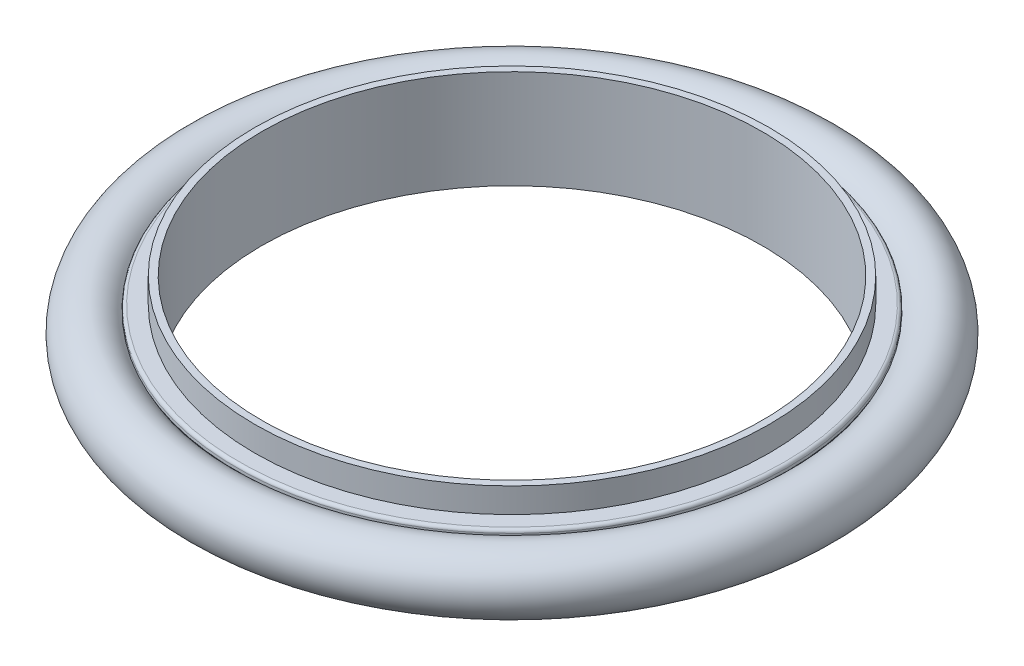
ISO-10303-21;
HEADER;
FILE_DESCRIPTION(('STEP AP214'),'2;1');
FILE_NAME('part.step','',(''),(''),'','','');
FILE_SCHEMA(('AUTOMOTIVE_DESIGN { 1 0 10303 214 1 1 1 1 }'));
ENDSEC;
DATA;
#1=APPLICATION_CONTEXT('core data for automotive mechanical design processes');
#2=APPLICATION_PROTOCOL_DEFINITION('international standard','automotive_design',2000,#1);
#3=PRODUCT_CONTEXT('',#1,'mechanical');
#4=PRODUCT('Part','Part','',(#3));
#5=PRODUCT_RELATED_PRODUCT_CATEGORY('part','',(#4));
#6=PRODUCT_DEFINITION_FORMATION('','',#4);
#7=PRODUCT_DEFINITION_CONTEXT('part definition',#1,'design');
#8=PRODUCT_DEFINITION('design','',#6,#7);
#9=PRODUCT_DEFINITION_SHAPE('','',#8);
#10=(LENGTH_UNIT() NAMED_UNIT(*) SI_UNIT(.MILLI.,.METRE.));
#11=(NAMED_UNIT(*) PLANE_ANGLE_UNIT() SI_UNIT($,.RADIAN.));
#12=(NAMED_UNIT(*) SI_UNIT($,.STERADIAN.) SOLID_ANGLE_UNIT());
#13=UNCERTAINTY_MEASURE_WITH_UNIT(LENGTH_MEASURE(1.E-05),#10,'distance_accuracy_value','');
#14=(GEOMETRIC_REPRESENTATION_CONTEXT(3) GLOBAL_UNCERTAINTY_ASSIGNED_CONTEXT((#13)) GLOBAL_UNIT_ASSIGNED_CONTEXT((#10,
#11,#12)) REPRESENTATION_CONTEXT('',''));
#15=CARTESIAN_POINT('',(0.,0.,0.));
#16=DIRECTION('',(0.,0.,1.));
#17=DIRECTION('',(1.,0.,0.));
#18=AXIS2_PLACEMENT_3D('',#15,#16,#17);
#19=CARTESIAN_POINT('',(0.,-1.11022302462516E-13,0.));
#20=DIRECTION('',(0.,1.,0.));
#21=DIRECTION('',(0.,0.,1.));
#22=AXIS2_PLACEMENT_3D('',#19,#20,#21);
#23=TOROIDAL_SURFACE('',#22,23.88235,2.38125);
#24=ADVANCED_FACE('P0_F13',(),#23,.T.);
#25=CLOSED_SHELL('',(#24));
#26=MANIFOLD_SOLID_BREP('P0_B1',#25);
#27=CARTESIAN_POINT('',(0.,1.1435867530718E-13,0.));
#28=DIRECTION('',(0.,1.,0.));
#29=DIRECTION('',(-1.,0.,0.));
#30=AXIS2_PLACEMENT_3D('',#27,#28,#29);
#31=TOROIDAL_SURFACE('',#30,24.0410999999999,2.54);
#32=CARTESIAN_POINT('',(0.,1.47183082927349,0.));
#33=DIRECTION('',(0.,1.,0.));
#34=DIRECTION('',(-1.,0.,0.));
#35=AXIS2_PLACEMENT_3D('',#32,#33,#34);
#36=CIRCLE('',#35,21.971);
#37=CARTESIAN_POINT('',(-21.971,1.47183082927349,0.));
#38=VERTEX_POINT('',#37);
#39=EDGE_CURVE('P1_E165',#38,#38,#36,.T.);
#40=ORIENTED_EDGE('',*,*,#39,.F.);
#41=EDGE_LOOP('',(#40));
#42=FACE_BOUND('',#41,.T.);
#43=CARTESIAN_POINT('',(-2.22044604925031E-13,-1.4718308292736,0.));
#44=DIRECTION('',(0.,1.,0.));
#45=DIRECTION('',(-1.,0.,0.));
#46=AXIS2_PLACEMENT_3D('',#43,#44,#45);
#47=CIRCLE('',#46,21.971);
#48=CARTESIAN_POINT('',(-21.971,-1.4718308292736,0.));
#49=VERTEX_POINT('',#48);
#50=EDGE_CURVE('P1_E167',#49,#49,#47,.F.);
#51=ORIENTED_EDGE('',*,*,#50,.F.);
#52=EDGE_LOOP('',(#51));
#53=FACE_BOUND('',#52,.T.);
#54=ADVANCED_FACE('P1_F18',(#42,#53),#31,.F.);
#55=CARTESIAN_POINT('',(0.,0.,0.));
#56=DIRECTION('',(0.,1.,0.));
#57=DIRECTION('',(-1.,0.,0.));
#58=AXIS2_PLACEMENT_3D('',#55,#56,#57);
#59=CYLINDRICAL_SURFACE('',#58,21.971);
#60=CARTESIAN_POINT('',(1.11022302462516E-13,1.70179999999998,0.));
#61=DIRECTION('',(0.,1.,0.));
#62=DIRECTION('',(-1.,0.,0.));
#63=AXIS2_PLACEMENT_3D('',#60,#61,#62);
#64=CIRCLE('',#63,21.971);
#65=CARTESIAN_POINT('',(-21.971,1.70179999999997,0.));
#66=VERTEX_POINT('',#65);
#67=EDGE_CURVE('P1_E169',#66,#66,#64,.T.);
#68=CARTESIAN_POINT('',(-21.971,1.47183082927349,0.));
#69=CARTESIAN_POINT('',(-21.971,1.47422634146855,0.));
#70=CARTESIAN_POINT('',(-21.971,1.47662185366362,0.));
#71=CARTESIAN_POINT('',(-21.971,1.48141287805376,0.));
#72=CARTESIAN_POINT('',(-21.971,1.48380839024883,0.));
#73=CARTESIAN_POINT('',(-21.971,1.48859941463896,0.));
#74=CARTESIAN_POINT('',(-21.971,1.49099492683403,0.));
#75=CARTESIAN_POINT('',(-21.971,1.49578595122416,0.));
#76=CARTESIAN_POINT('',(-21.971,1.49818146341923,0.));
#77=CARTESIAN_POINT('',(-21.971,1.50297248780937,0.));
#78=CARTESIAN_POINT('',(-21.971,1.50536800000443,0.));
#79=CARTESIAN_POINT('',(-21.971,1.51015902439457,0.));
#80=CARTESIAN_POINT('',(-21.971,1.51255453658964,0.));
#81=CARTESIAN_POINT('',(-21.971,1.51734556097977,0.));
#82=CARTESIAN_POINT('',(-21.971,1.51974107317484,0.));
#83=CARTESIAN_POINT('',(-21.971,1.52453209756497,0.));
#84=CARTESIAN_POINT('',(-21.971,1.52692760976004,0.));
#85=CARTESIAN_POINT('',(-21.971,1.53171863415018,0.));
#86=CARTESIAN_POINT('',(-21.971,1.53411414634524,0.));
#87=CARTESIAN_POINT('',(-21.971,1.53890517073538,0.));
#88=CARTESIAN_POINT('',(-21.971,1.54130068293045,0.));
#89=CARTESIAN_POINT('',(-21.971,1.54609170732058,0.));
#90=CARTESIAN_POINT('',(-21.971,1.54848721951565,0.));
#91=CARTESIAN_POINT('',(-21.971,1.55327824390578,0.));
#92=CARTESIAN_POINT('',(-21.971,1.55567375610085,0.));
#93=CARTESIAN_POINT('',(-21.971,1.56046478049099,0.));
#94=CARTESIAN_POINT('',(-21.971,1.56286029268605,0.));
#95=CARTESIAN_POINT('',(-21.971,1.56765131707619,0.));
#96=CARTESIAN_POINT('',(-21.971,1.57004682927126,0.));
#97=CARTESIAN_POINT('',(-21.971,1.57483785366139,0.));
#98=CARTESIAN_POINT('',(-21.971,1.57723336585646,0.));
#99=CARTESIAN_POINT('',(-21.971,1.58202439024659,0.));
#100=CARTESIAN_POINT('',(-21.971,1.58441990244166,0.));
#101=CARTESIAN_POINT('',(-21.971,1.5892109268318,0.));
#102=CARTESIAN_POINT('',(-21.971,1.59160643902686,0.));
#103=CARTESIAN_POINT('',(-21.971,1.596397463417,0.));
#104=CARTESIAN_POINT('',(-21.971,1.59879297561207,0.));
#105=CARTESIAN_POINT('',(-21.971,1.6035840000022,0.));
#106=CARTESIAN_POINT('',(-21.971,1.60597951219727,0.));
#107=CARTESIAN_POINT('',(-21.971,1.61077053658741,0.));
#108=CARTESIAN_POINT('',(-21.971,1.61316604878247,0.));
#109=CARTESIAN_POINT('',(-21.971,1.61795707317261,0.));
#110=CARTESIAN_POINT('',(-21.971,1.62035258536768,0.));
#111=CARTESIAN_POINT('',(-21.971,1.62514360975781,0.));
#112=CARTESIAN_POINT('',(-21.971,1.62753912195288,0.));
#113=CARTESIAN_POINT('',(-21.971,1.63233014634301,0.));
#114=CARTESIAN_POINT('',(-21.971,1.63472565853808,0.));
#115=CARTESIAN_POINT('',(-21.971,1.63951668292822,0.));
#116=CARTESIAN_POINT('',(-21.971,1.64191219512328,0.));
#117=CARTESIAN_POINT('',(-21.971,1.64670321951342,0.));
#118=CARTESIAN_POINT('',(-21.971,1.64909873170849,0.));
#119=CARTESIAN_POINT('',(-21.971,1.65388975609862,0.));
#120=CARTESIAN_POINT('',(-21.971,1.65628526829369,0.));
#121=CARTESIAN_POINT('',(-21.971,1.66107629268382,0.));
#122=CARTESIAN_POINT('',(-21.971,1.66347180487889,0.));
#123=CARTESIAN_POINT('',(-21.971,1.66826282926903,0.));
#124=CARTESIAN_POINT('',(-21.971,1.67065834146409,0.));
#125=CARTESIAN_POINT('',(-21.971,1.67544936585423,0.));
#126=CARTESIAN_POINT('',(-21.971,1.6778448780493,0.));
#127=CARTESIAN_POINT('',(-21.971,1.68263590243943,0.));
#128=CARTESIAN_POINT('',(-21.971,1.6850314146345,0.));
#129=CARTESIAN_POINT('',(-21.971,1.68982243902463,0.));
#130=CARTESIAN_POINT('',(-21.971,1.6922179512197,0.));
#131=CARTESIAN_POINT('',(-21.971,1.69700897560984,0.));
#132=CARTESIAN_POINT('',(-21.971,1.6994044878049,0.));
#133=CARTESIAN_POINT('',(-21.971,1.70179999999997,0.));
#134=B_SPLINE_CURVE_WITH_KNOTS('',3,(#68,#69,#70,#71,#72,#73,#74,#75,#76,#77,#78,#79,#80,#81,
#82,#83,#84,#85,#86,#87,#88,#89,#90,#91,#92,#93,#94,#95,#96,#97,#98,#99,#100,#101,#102,#103,
#104,#105,#106,#107,#108,#109,#110,#111,#112,#113,#114,#115,#116,#117,#118,#119,#120,#121,#122,
#123,#124,#125,#126,#127,#128,#129,#130,#131,#132,#133),.UNSPECIFIED.,.F.,.F.,(4,2,2,2,2,2,2,2,
2,2,2,2,2,2,2,2,2,2,2,2,2,2,2,2,2,2,2,2,2,2,2,2,4),(0.,0.00718653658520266,0.0143730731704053,
0.021559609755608,0.0287461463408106,0.0359326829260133,0.0431192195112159,0.0503057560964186,
0.0574922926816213,0.0646788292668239,0.0718653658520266,0.0790519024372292,0.0862384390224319,
0.0934249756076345,0.100611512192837,0.10779804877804,0.114984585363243,0.122171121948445,
0.129357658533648,0.13654419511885,0.143730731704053,0.150917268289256,0.158103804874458,
0.165290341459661,0.172476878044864,0.179663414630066,0.186849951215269,0.194036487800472,
0.201223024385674,0.208409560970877,0.21559609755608,0.222782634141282,0.229969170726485),.UNSPECIFIED.);
#135=EDGE_CURVE('P1_BSEAM84',#38,#66,#134,.T.);
#136=ORIENTED_EDGE('',*,*,#39,.T.);
#137=ORIENTED_EDGE('',*,*,#67,.F.);
#138=ORIENTED_EDGE('',*,*,#135,.T.);
#139=ORIENTED_EDGE('',*,*,#135,.F.);
#140=EDGE_LOOP('',(#136,#138,#137,#139));
#141=FACE_BOUND('',#140,.T.);
#142=ADVANCED_FACE('P1_F84',(#141),#59,.T.);
#143=CARTESIAN_POINT('',(0.,0.,0.));
#144=DIRECTION('',(0.,1.,0.));
#145=DIRECTION('',(-1.,0.,0.));
#146=AXIS2_PLACEMENT_3D('',#143,#144,#145);
#147=CYLINDRICAL_SURFACE('',#146,21.971);
#148=CARTESIAN_POINT('',(0.,-1.70180000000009,0.));
#149=DIRECTION('',(0.,1.,0.));
#150=DIRECTION('',(-1.,0.,0.));
#151=AXIS2_PLACEMENT_3D('',#148,#149,#150);
#152=CIRCLE('',#151,21.971);
#153=CARTESIAN_POINT('',(-21.971,-1.70180000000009,0.));
#154=VERTEX_POINT('',#153);
#155=EDGE_CURVE('P1_E54',#154,#154,#152,.F.);
#156=CARTESIAN_POINT('',(-21.971,-1.70180000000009,0.));
#157=CARTESIAN_POINT('',(-21.971,-1.69940448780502,0.));
#158=CARTESIAN_POINT('',(-21.971,-1.69700897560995,0.));
#159=CARTESIAN_POINT('',(-21.971,-1.69221795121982,0.));
#160=CARTESIAN_POINT('',(-21.971,-1.68982243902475,0.));
#161=CARTESIAN_POINT('',(-21.971,-1.68503141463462,0.));
#162=CARTESIAN_POINT('',(-21.971,-1.68263590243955,0.));
#163=CARTESIAN_POINT('',(-21.971,-1.67784487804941,0.));
#164=CARTESIAN_POINT('',(-21.971,-1.67544936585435,0.));
#165=CARTESIAN_POINT('',(-21.971,-1.67065834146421,0.));
#166=CARTESIAN_POINT('',(-21.971,-1.66826282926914,0.));
#167=CARTESIAN_POINT('',(-21.971,-1.66347180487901,0.));
#168=CARTESIAN_POINT('',(-21.971,-1.66107629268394,0.));
#169=CARTESIAN_POINT('',(-21.971,-1.65628526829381,0.));
#170=CARTESIAN_POINT('',(-21.971,-1.65388975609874,0.));
#171=CARTESIAN_POINT('',(-21.971,-1.6490987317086,0.));
#172=CARTESIAN_POINT('',(-21.971,-1.64670321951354,0.));
#173=CARTESIAN_POINT('',(-21.971,-1.6419121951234,0.));
#174=CARTESIAN_POINT('',(-21.971,-1.63951668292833,0.));
#175=CARTESIAN_POINT('',(-21.971,-1.6347256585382,0.));
#176=CARTESIAN_POINT('',(-21.971,-1.63233014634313,0.));
#177=CARTESIAN_POINT('',(-21.971,-1.627539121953,0.));
#178=CARTESIAN_POINT('',(-21.971,-1.62514360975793,0.));
#179=CARTESIAN_POINT('',(-21.971,-1.62035258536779,0.));
#180=CARTESIAN_POINT('',(-21.971,-1.61795707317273,0.));
#181=CARTESIAN_POINT('',(-21.971,-1.61316604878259,0.));
#182=CARTESIAN_POINT('',(-21.971,-1.61077053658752,0.));
#183=CARTESIAN_POINT('',(-21.971,-1.60597951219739,0.));
#184=CARTESIAN_POINT('',(-21.971,-1.60358400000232,0.));
#185=CARTESIAN_POINT('',(-21.971,-1.59879297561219,0.));
#186=CARTESIAN_POINT('',(-21.971,-1.59639746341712,0.));
#187=CARTESIAN_POINT('',(-21.971,-1.59160643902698,0.));
#188=CARTESIAN_POINT('',(-21.971,-1.58921092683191,0.));
#189=CARTESIAN_POINT('',(-21.971,-1.58441990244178,0.));
#190=CARTESIAN_POINT('',(-21.971,-1.58202439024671,0.));
#191=CARTESIAN_POINT('',(-21.971,-1.57723336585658,0.));
#192=CARTESIAN_POINT('',(-21.971,-1.57483785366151,0.));
#193=CARTESIAN_POINT('',(-21.971,-1.57004682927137,0.));
#194=CARTESIAN_POINT('',(-21.971,-1.56765131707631,0.));
#195=CARTESIAN_POINT('',(-21.971,-1.56286029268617,0.));
#196=CARTESIAN_POINT('',(-21.971,-1.5604647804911,0.));
#197=CARTESIAN_POINT('',(-21.971,-1.55567375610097,0.));
#198=CARTESIAN_POINT('',(-21.971,-1.5532782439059,0.));
#199=CARTESIAN_POINT('',(-21.971,-1.54848721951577,0.));
#200=CARTESIAN_POINT('',(-21.971,-1.5460917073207,0.));
#201=CARTESIAN_POINT('',(-21.971,-1.54130068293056,0.));
#202=CARTESIAN_POINT('',(-21.971,-1.5389051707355,0.));
#203=CARTESIAN_POINT('',(-21.971,-1.53411414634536,0.));
#204=CARTESIAN_POINT('',(-21.971,-1.53171863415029,0.));
#205=CARTESIAN_POINT('',(-21.971,-1.52692760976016,0.));
#206=CARTESIAN_POINT('',(-21.971,-1.52453209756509,0.));
#207=CARTESIAN_POINT('',(-21.971,-1.51974107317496,0.));
#208=CARTESIAN_POINT('',(-21.971,-1.51734556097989,0.));
#209=CARTESIAN_POINT('',(-21.971,-1.51255453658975,0.));
#210=CARTESIAN_POINT('',(-21.971,-1.51015902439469,0.));
#211=CARTESIAN_POINT('',(-21.971,-1.50536800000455,0.));
#212=CARTESIAN_POINT('',(-21.971,-1.50297248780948,0.));
#213=CARTESIAN_POINT('',(-21.971,-1.49818146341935,0.));
#214=CARTESIAN_POINT('',(-21.971,-1.49578595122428,0.));
#215=CARTESIAN_POINT('',(-21.971,-1.49099492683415,0.));
#216=CARTESIAN_POINT('',(-21.971,-1.48859941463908,0.));
#217=CARTESIAN_POINT('',(-21.971,-1.48380839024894,0.));
#218=CARTESIAN_POINT('',(-21.971,-1.48141287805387,0.));
#219=CARTESIAN_POINT('',(-21.971,-1.47662185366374,0.));
#220=CARTESIAN_POINT('',(-21.971,-1.47422634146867,0.));
#221=CARTESIAN_POINT('',(-21.971,-1.4718308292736,0.));
#222=B_SPLINE_CURVE_WITH_KNOTS('',3,(#156,#157,#158,#159,#160,#161,#162,#163,#164,#165,#166,
#167,#168,#169,#170,#171,#172,#173,#174,#175,#176,#177,#178,#179,#180,#181,#182,#183,#184,#185,
#186,#187,#188,#189,#190,#191,#192,#193,#194,#195,#196,#197,#198,#199,#200,#201,#202,#203,#204,
#205,#206,#207,#208,#209,#210,#211,#212,#213,#214,#215,#216,#217,#218,#219,#220,#221),
.UNSPECIFIED.,.F.,.F.,(4,2,2,2,2,2,2,2,2,2,2,2,2,2,2,2,2,2,2,2,2,2,2,2,2,2,2,2,2,2,2,2,4),(0.,
0.00718653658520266,0.0143730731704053,0.021559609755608,0.0287461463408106,0.0359326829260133,
0.0431192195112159,0.0503057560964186,0.0574922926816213,0.0646788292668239,0.0718653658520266,
0.0790519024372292,0.0862384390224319,0.0934249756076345,0.100611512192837,0.10779804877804,
0.114984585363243,0.122171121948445,0.129357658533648,0.13654419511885,0.143730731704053,
0.150917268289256,0.158103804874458,0.165290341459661,0.172476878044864,0.179663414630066,
0.186849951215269,0.194036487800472,0.201223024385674,0.208409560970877,0.21559609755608,
0.222782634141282,0.229969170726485),.UNSPECIFIED.);
#223=EDGE_CURVE('P1_BSEAM77',#154,#49,#222,.T.);
#224=ORIENTED_EDGE('',*,*,#155,.F.);
#225=ORIENTED_EDGE('',*,*,#50,.T.);
#226=ORIENTED_EDGE('',*,*,#223,.T.);
#227=ORIENTED_EDGE('',*,*,#223,.F.);
#228=EDGE_LOOP('',(#224,#226,#225,#227));
#229=FACE_BOUND('',#228,.T.);
#230=ADVANCED_FACE('P1_F77',(#229),#147,.T.);
#231=CARTESIAN_POINT('',(1.11022302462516E-13,1.70179999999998,0.));
#232=DIRECTION('',(0.,1.,0.));
#233=DIRECTION('',(-1.,0.,0.));
#234=AXIS2_PLACEMENT_3D('',#231,#232,#233);
#235=TOROIDAL_SURFACE('',#234,21.717,0.253999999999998);
#236=ORIENTED_EDGE('',*,*,#67,.T.);
#237=EDGE_LOOP('',(#236));
#238=FACE_BOUND('',#237,.T.);
#239=CARTESIAN_POINT('',(1.10987052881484E-13,1.95579999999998,0.));
#240=DIRECTION('',(0.,-1.,0.));
#241=DIRECTION('',(-1.,0.,0.));
#242=AXIS2_PLACEMENT_3D('',#239,#240,#241);
#243=CIRCLE('',#242,21.717);
#244=CARTESIAN_POINT('',(21.7170000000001,1.95579999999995,0.));
#245=VERTEX_POINT('',#244);
#246=CARTESIAN_POINT('',(-21.7169999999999,1.95579999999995,0.));
#247=VERTEX_POINT('',#246);
#248=EDGE_CURVE('P1_E47',#245,#247,#243,.F.);
#249=ORIENTED_EDGE('',*,*,#248,.F.);
#250=CARTESIAN_POINT('',(1.10987052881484E-13,1.95579999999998,0.));
#251=DIRECTION('',(0.,-1.,0.));
#252=DIRECTION('',(1.,0.,0.));
#253=AXIS2_PLACEMENT_3D('',#250,#251,#252);
#254=CIRCLE('',#253,21.717);
#255=EDGE_CURVE('P1_E50',#247,#245,#254,.F.);
#256=ORIENTED_EDGE('',*,*,#255,.F.);
#257=EDGE_LOOP('',(#249,#256));
#258=FACE_BOUND('',#257,.T.);
#259=ADVANCED_FACE('P1_F58',(#238,#258),#235,.T.);
#260=CARTESIAN_POINT('',(0.,-1.70180000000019,0.));
#261=DIRECTION('',(0.,1.,0.));
#262=DIRECTION('',(-1.,0.,0.));
#263=AXIS2_PLACEMENT_3D('',#260,#261,#262);
#264=TOROIDAL_SURFACE('',#263,21.7169999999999,0.253999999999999);
#265=CARTESIAN_POINT('',(0.,-1.95580000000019,0.));
#266=DIRECTION('',(0.,1.,0.));
#267=DIRECTION('',(-1.,0.,0.));
#268=AXIS2_PLACEMENT_3D('',#265,#266,#267);
#269=CIRCLE('',#268,21.7169999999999);
#270=CARTESIAN_POINT('',(21.7169999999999,-1.95580000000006,0.));
#271=VERTEX_POINT('',#270);
#272=CARTESIAN_POINT('',(-21.717,-1.95580000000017,0.));
#273=VERTEX_POINT('',#272);
#274=EDGE_CURVE('P1_E38',#271,#273,#269,.F.);
#275=ORIENTED_EDGE('',*,*,#274,.F.);
#276=CARTESIAN_POINT('',(0.,-1.95580000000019,0.));
#277=DIRECTION('',(0.,1.,0.));
#278=DIRECTION('',(1.,0.,0.));
#279=AXIS2_PLACEMENT_3D('',#276,#277,#278);
#280=CIRCLE('',#279,21.7169999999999);
#281=EDGE_CURVE('P1_E136',#273,#271,#280,.F.);
#282=ORIENTED_EDGE('',*,*,#281,.F.);
#283=EDGE_LOOP('',(#275,#282));
#284=FACE_BOUND('',#283,.T.);
#285=ORIENTED_EDGE('',*,*,#155,.T.);
#286=EDGE_LOOP('',(#285));
#287=FACE_BOUND('',#286,.T.);
#288=ADVANCED_FACE('P1_F76',(#284,#287),#264,.T.);
#289=CARTESIAN_POINT('',(-20.4977999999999,1.95579999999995,0.));
#290=DIRECTION('',(0.,1.,0.));
#291=DIRECTION('',(-1.,0.,0.));
#292=AXIS2_PLACEMENT_3D('',#289,#290,#291);
#293=PLANE('',#292);
#294=CARTESIAN_POINT('',(1.11022302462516E-13,1.95579999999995,0.));
#295=DIRECTION('',(0.,1.,0.));
#296=DIRECTION('',(-1.,0.,0.));
#297=AXIS2_PLACEMENT_3D('',#294,#295,#296);
#298=CIRCLE('',#297,20.4978);
#299=CARTESIAN_POINT('',(-20.4978,1.95579999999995,0.));
#300=VERTEX_POINT('',#299);
#301=EDGE_CURVE('P1_E140',#300,#300,#298,.T.);
#302=ORIENTED_EDGE('',*,*,#301,.F.);
#303=EDGE_LOOP('',(#302));
#304=FACE_BOUND('',#303,.T.);
#305=ORIENTED_EDGE('',*,*,#255,.T.);
#306=ORIENTED_EDGE('',*,*,#248,.T.);
#307=EDGE_LOOP('',(#305,#306));
#308=FACE_BOUND('',#307,.T.);
#309=ADVANCED_FACE('P1_F52',(#304,#308),#293,.T.);
#310=CARTESIAN_POINT('',(-20.4978,-1.95580000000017,0.));
#311=DIRECTION('',(0.,-1.,0.));
#312=DIRECTION('',(1.,0.,0.));
#313=AXIS2_PLACEMENT_3D('',#310,#311,#312);
#314=PLANE('',#313);
#315=ORIENTED_EDGE('',*,*,#274,.T.);
#316=ORIENTED_EDGE('',*,*,#281,.T.);
#317=EDGE_LOOP('',(#315,#316));
#318=FACE_BOUND('',#317,.T.);
#319=CARTESIAN_POINT('',(1.11022302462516E-13,-1.95580000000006,0.));
#320=DIRECTION('',(0.,1.,0.));
#321=DIRECTION('',(-1.,0.,0.));
#322=AXIS2_PLACEMENT_3D('',#319,#320,#321);
#323=CIRCLE('',#322,20.4978);
#324=CARTESIAN_POINT('',(-20.4978,-1.95580000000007,0.));
#325=VERTEX_POINT('',#324);
#326=EDGE_CURVE('P1_E154',#325,#325,#323,.F.);
#327=ORIENTED_EDGE('',*,*,#326,.F.);
#328=EDGE_LOOP('',(#327));
#329=FACE_BOUND('',#328,.T.);
#330=ADVANCED_FACE('P1_F119',(#318,#329),#314,.T.);
#331=CARTESIAN_POINT('',(0.,0.,0.));
#332=DIRECTION('',(0.,1.,0.));
#333=DIRECTION('',(-1.,0.,0.));
#334=AXIS2_PLACEMENT_3D('',#331,#332,#333);
#335=CYLINDRICAL_SURFACE('',#334,20.4978);
#336=CARTESIAN_POINT('',(0.,3.93699999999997,0.));
#337=DIRECTION('',(0.,1.,0.));
#338=DIRECTION('',(-1.,0.,0.));
#339=AXIS2_PLACEMENT_3D('',#336,#337,#338);
#340=CIRCLE('',#339,20.4978);
#341=CARTESIAN_POINT('',(-20.4978,3.93699999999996,0.));
#342=VERTEX_POINT('',#341);
#343=EDGE_CURVE('P1_E157',#342,#342,#340,.T.);
#344=CARTESIAN_POINT('',(-20.4978,1.95579999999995,0.));
#345=CARTESIAN_POINT('',(-20.4978,1.97643749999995,0.));
#346=CARTESIAN_POINT('',(-20.4978,1.99707499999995,0.));
#347=CARTESIAN_POINT('',(-20.4978,2.03834999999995,0.));
#348=CARTESIAN_POINT('',(-20.4978,2.05898749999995,0.));
#349=CARTESIAN_POINT('',(-20.4978,2.10026249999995,0.));
#350=CARTESIAN_POINT('',(-20.4978,2.12089999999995,0.));
#351=CARTESIAN_POINT('',(-20.4978,2.16217499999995,0.));
#352=CARTESIAN_POINT('',(-20.4978,2.18281249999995,0.));
#353=CARTESIAN_POINT('',(-20.4978,2.22408749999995,0.));
#354=CARTESIAN_POINT('',(-20.4978,2.24472499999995,0.));
#355=CARTESIAN_POINT('',(-20.4978,2.28599999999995,0.));
#356=CARTESIAN_POINT('',(-20.4978,2.30663749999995,0.));
#357=CARTESIAN_POINT('',(-20.4978,2.34791249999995,0.));
#358=CARTESIAN_POINT('',(-20.4978,2.36854999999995,0.));
#359=CARTESIAN_POINT('',(-20.4978,2.40982499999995,0.));
#360=CARTESIAN_POINT('',(-20.4978,2.43046249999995,0.));
#361=CARTESIAN_POINT('',(-20.4978,2.47173749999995,0.));
#362=CARTESIAN_POINT('',(-20.4978,2.49237499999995,0.));
#363=CARTESIAN_POINT('',(-20.4978,2.53364999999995,0.));
#364=CARTESIAN_POINT('',(-20.4978,2.55428749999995,0.));
#365=CARTESIAN_POINT('',(-20.4978,2.59556249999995,0.));
#366=CARTESIAN_POINT('',(-20.4978,2.61619999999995,0.));
#367=CARTESIAN_POINT('',(-20.4978,2.65747499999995,0.));
#368=CARTESIAN_POINT('',(-20.4978,2.67811249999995,0.));
#369=CARTESIAN_POINT('',(-20.4978,2.71938749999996,0.));
#370=CARTESIAN_POINT('',(-20.4978,2.74002499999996,0.));
#371=CARTESIAN_POINT('',(-20.4978,2.78129999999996,0.));
#372=CARTESIAN_POINT('',(-20.4978,2.80193749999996,0.));
#373=CARTESIAN_POINT('',(-20.4978,2.84321249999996,0.));
#374=CARTESIAN_POINT('',(-20.4978,2.86384999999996,0.));
#375=CARTESIAN_POINT('',(-20.4978,2.90512499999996,0.));
#376=CARTESIAN_POINT('',(-20.4978,2.92576249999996,0.));
#377=CARTESIAN_POINT('',(-20.4978,2.96703749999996,0.));
#378=CARTESIAN_POINT('',(-20.4978,2.98767499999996,0.));
#379=CARTESIAN_POINT('',(-20.4978,3.02894999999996,0.));
#380=CARTESIAN_POINT('',(-20.4978,3.04958749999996,0.));
#381=CARTESIAN_POINT('',(-20.4978,3.09086249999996,0.));
#382=CARTESIAN_POINT('',(-20.4978,3.11149999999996,0.));
#383=CARTESIAN_POINT('',(-20.4978,3.15277499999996,0.));
#384=CARTESIAN_POINT('',(-20.4978,3.17341249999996,0.));
#385=CARTESIAN_POINT('',(-20.4978,3.21468749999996,0.));
#386=CARTESIAN_POINT('',(-20.4978,3.23532499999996,0.));
#387=CARTESIAN_POINT('',(-20.4978,3.27659999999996,0.));
#388=CARTESIAN_POINT('',(-20.4978,3.29723749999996,0.));
#389=CARTESIAN_POINT('',(-20.4978,3.33851249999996,0.));
#390=CARTESIAN_POINT('',(-20.4978,3.35914999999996,0.));
#391=CARTESIAN_POINT('',(-20.4978,3.40042499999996,0.));
#392=CARTESIAN_POINT('',(-20.4978,3.42106249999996,0.));
#393=CARTESIAN_POINT('',(-20.4978,3.46233749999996,0.));
#394=CARTESIAN_POINT('',(-20.4978,3.48297499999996,0.));
#395=CARTESIAN_POINT('',(-20.4978,3.52424999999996,0.));
#396=CARTESIAN_POINT('',(-20.4978,3.54488749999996,0.));
#397=CARTESIAN_POINT('',(-20.4978,3.58616249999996,0.));
#398=CARTESIAN_POINT('',(-20.4978,3.60679999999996,0.));
#399=CARTESIAN_POINT('',(-20.4978,3.64807499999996,0.));
#400=CARTESIAN_POINT('',(-20.4978,3.66871249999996,0.));
#401=CARTESIAN_POINT('',(-20.4978,3.70998749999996,0.));
#402=CARTESIAN_POINT('',(-20.4978,3.73062499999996,0.));
#403=CARTESIAN_POINT('',(-20.4978,3.77189999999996,0.));
#404=CARTESIAN_POINT('',(-20.4978,3.79253749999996,0.));
#405=CARTESIAN_POINT('',(-20.4978,3.83381249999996,0.));
#406=CARTESIAN_POINT('',(-20.4978,3.85444999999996,0.));
#407=CARTESIAN_POINT('',(-20.4978,3.89572499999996,0.));
#408=CARTESIAN_POINT('',(-20.4978,3.91636249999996,0.));
#409=CARTESIAN_POINT('',(-20.4978,3.93699999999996,0.));
#410=B_SPLINE_CURVE_WITH_KNOTS('',3,(#344,#345,#346,#347,#348,#349,#350,#351,#352,#353,#354,
#355,#356,#357,#358,#359,#360,#361,#362,#363,#364,#365,#366,#367,#368,#369,#370,#371,#372,#373,
#374,#375,#376,#377,#378,#379,#380,#381,#382,#383,#384,#385,#386,#387,#388,#389,#390,#391,#392,
#393,#394,#395,#396,#397,#398,#399,#400,#401,#402,#403,#404,#405,#406,#407,#408,#409),
.UNSPECIFIED.,.F.,.F.,(4,2,2,2,2,2,2,2,2,2,2,2,2,2,2,2,2,2,2,2,2,2,2,2,2,2,2,2,2,2,2,2,4),(0.,
0.0619125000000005,0.123825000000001,0.185737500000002,0.247650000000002,0.309562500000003,
0.371475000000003,0.433387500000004,0.495300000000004,0.557212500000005,0.619125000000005,
0.681037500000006,0.742950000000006,0.804862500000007,0.866775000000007,0.928687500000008,
0.990600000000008,1.05251250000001,1.11442500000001,1.17633750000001,1.23825000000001,
1.30016250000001,1.36207500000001,1.42398750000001,1.48590000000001,1.54781250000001,
1.60972500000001,1.67163750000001,1.73355000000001,1.79546250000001,1.85737500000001,
1.91928750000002,1.98120000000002),.UNSPECIFIED.);
#411=EDGE_CURVE('P1_BSEAM115',#300,#342,#410,.T.);
#412=ORIENTED_EDGE('',*,*,#301,.T.);
#413=ORIENTED_EDGE('',*,*,#343,.F.);
#414=ORIENTED_EDGE('',*,*,#411,.T.);
#415=ORIENTED_EDGE('',*,*,#411,.F.);
#416=EDGE_LOOP('',(#412,#414,#413,#415));
#417=FACE_BOUND('',#416,.T.);
#418=ADVANCED_FACE('P1_F115',(#417),#335,.T.);
#419=CARTESIAN_POINT('',(0.,0.,0.));
#420=DIRECTION('',(0.,1.,0.));
#421=DIRECTION('',(-1.,0.,0.));
#422=AXIS2_PLACEMENT_3D('',#419,#420,#421);
#423=CYLINDRICAL_SURFACE('',#422,20.4978);
#424=CARTESIAN_POINT('',(0.,-3.93700000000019,0.));
#425=DIRECTION('',(0.,1.,0.));
#426=DIRECTION('',(-1.,0.,0.));
#427=AXIS2_PLACEMENT_3D('',#424,#425,#426);
#428=CIRCLE('',#427,20.4978);
#429=CARTESIAN_POINT('',(-20.4978,-3.93700000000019,0.));
#430=VERTEX_POINT('',#429);
#431=EDGE_CURVE('P1_E160',#430,#430,#428,.F.);
#432=CARTESIAN_POINT('',(-20.4978,-3.93700000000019,0.));
#433=CARTESIAN_POINT('',(-20.4978,-3.91636250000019,0.));
#434=CARTESIAN_POINT('',(-20.4978,-3.89572500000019,0.));
#435=CARTESIAN_POINT('',(-20.4978,-3.85445000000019,0.));
#436=CARTESIAN_POINT('',(-20.4978,-3.83381250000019,0.));
#437=CARTESIAN_POINT('',(-20.4978,-3.79253750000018,0.));
#438=CARTESIAN_POINT('',(-20.4978,-3.77190000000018,0.));
#439=CARTESIAN_POINT('',(-20.4978,-3.73062500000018,0.));
#440=CARTESIAN_POINT('',(-20.4978,-3.70998750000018,0.));
#441=CARTESIAN_POINT('',(-20.4978,-3.66871250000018,0.));
#442=CARTESIAN_POINT('',(-20.4978,-3.64807500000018,0.));
#443=CARTESIAN_POINT('',(-20.4978,-3.60680000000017,0.));
#444=CARTESIAN_POINT('',(-20.4978,-3.58616250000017,0.));
#445=CARTESIAN_POINT('',(-20.4978,-3.54488750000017,0.));
#446=CARTESIAN_POINT('',(-20.4978,-3.52425000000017,0.));
#447=CARTESIAN_POINT('',(-20.4978,-3.48297500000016,0.));
#448=CARTESIAN_POINT('',(-20.4978,-3.46233750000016,0.));
#449=CARTESIAN_POINT('',(-20.4978,-3.42106250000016,0.));
#450=CARTESIAN_POINT('',(-20.4978,-3.40042500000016,0.));
#451=CARTESIAN_POINT('',(-20.4978,-3.35915000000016,0.));
#452=CARTESIAN_POINT('',(-20.4978,-3.33851250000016,0.));
#453=CARTESIAN_POINT('',(-20.4978,-3.29723750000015,0.));
#454=CARTESIAN_POINT('',(-20.4978,-3.27660000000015,0.));
#455=CARTESIAN_POINT('',(-20.4978,-3.23532500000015,0.));
#456=CARTESIAN_POINT('',(-20.4978,-3.21468750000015,0.));
#457=CARTESIAN_POINT('',(-20.4978,-3.17341250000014,0.));
#458=CARTESIAN_POINT('',(-20.4978,-3.15277500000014,0.));
#459=CARTESIAN_POINT('',(-20.4978,-3.11150000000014,0.));
#460=CARTESIAN_POINT('',(-20.4978,-3.09086250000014,0.));
#461=CARTESIAN_POINT('',(-20.4978,-3.04958750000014,0.));
#462=CARTESIAN_POINT('',(-20.4978,-3.02895000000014,0.));
#463=CARTESIAN_POINT('',(-20.4978,-2.98767500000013,0.));
#464=CARTESIAN_POINT('',(-20.4978,-2.96703750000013,0.));
#465=CARTESIAN_POINT('',(-20.4978,-2.92576250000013,0.));
#466=CARTESIAN_POINT('',(-20.4978,-2.90512500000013,0.));
#467=CARTESIAN_POINT('',(-20.4978,-2.86385000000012,0.));
#468=CARTESIAN_POINT('',(-20.4978,-2.84321250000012,0.));
#469=CARTESIAN_POINT('',(-20.4978,-2.80193750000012,0.));
#470=CARTESIAN_POINT('',(-20.4978,-2.78130000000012,0.));
#471=CARTESIAN_POINT('',(-20.4978,-2.74002500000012,0.));
#472=CARTESIAN_POINT('',(-20.4978,-2.71938750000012,0.));
#473=CARTESIAN_POINT('',(-20.4978,-2.67811250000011,0.));
#474=CARTESIAN_POINT('',(-20.4978,-2.65747500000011,0.));
#475=CARTESIAN_POINT('',(-20.4978,-2.61620000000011,0.));
#476=CARTESIAN_POINT('',(-20.4978,-2.59556250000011,0.));
#477=CARTESIAN_POINT('',(-20.4978,-2.5542875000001,0.));
#478=CARTESIAN_POINT('',(-20.4978,-2.5336500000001,0.));
#479=CARTESIAN_POINT('',(-20.4978,-2.4923750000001,0.));
#480=CARTESIAN_POINT('',(-20.4978,-2.4717375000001,0.));
#481=CARTESIAN_POINT('',(-20.4978,-2.4304625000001,0.));
#482=CARTESIAN_POINT('',(-20.4978,-2.4098250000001,0.));
#483=CARTESIAN_POINT('',(-20.4978,-2.36855000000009,0.));
#484=CARTESIAN_POINT('',(-20.4978,-2.34791250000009,0.));
#485=CARTESIAN_POINT('',(-20.4978,-2.30663750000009,0.));
#486=CARTESIAN_POINT('',(-20.4978,-2.28600000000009,0.));
#487=CARTESIAN_POINT('',(-20.4978,-2.24472500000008,0.));
#488=CARTESIAN_POINT('',(-20.4978,-2.22408750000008,0.));
#489=CARTESIAN_POINT('',(-20.4978,-2.18281250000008,0.));
#490=CARTESIAN_POINT('',(-20.4978,-2.16217500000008,0.));
#491=CARTESIAN_POINT('',(-20.4978,-2.12090000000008,0.));
#492=CARTESIAN_POINT('',(-20.4978,-2.10026250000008,0.));
#493=CARTESIAN_POINT('',(-20.4978,-2.05898750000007,0.));
#494=CARTESIAN_POINT('',(-20.4978,-2.03835000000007,0.));
#495=CARTESIAN_POINT('',(-20.4978,-1.99707500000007,0.));
#496=CARTESIAN_POINT('',(-20.4978,-1.97643750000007,0.));
#497=CARTESIAN_POINT('',(-20.4978,-1.95580000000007,0.));
#498=B_SPLINE_CURVE_WITH_KNOTS('',3,(#432,#433,#434,#435,#436,#437,#438,#439,#440,#441,#442,
#443,#444,#445,#446,#447,#448,#449,#450,#451,#452,#453,#454,#455,#456,#457,#458,#459,#460,#461,
#462,#463,#464,#465,#466,#467,#468,#469,#470,#471,#472,#473,#474,#475,#476,#477,#478,#479,#480,
#481,#482,#483,#484,#485,#486,#487,#488,#489,#490,#491,#492,#493,#494,#495,#496,#497),
.UNSPECIFIED.,.F.,.F.,(4,2,2,2,2,2,2,2,2,2,2,2,2,2,2,2,2,2,2,2,2,2,2,2,2,2,2,2,2,2,2,2,4),(0.,
0.061912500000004,0.123825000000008,0.185737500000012,0.247650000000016,0.30956250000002,
0.371475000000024,0.433387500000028,0.495300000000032,0.557212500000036,0.61912500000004,
0.681037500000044,0.742950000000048,0.804862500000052,0.866775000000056,0.92868750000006,
0.990600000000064,1.05251250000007,1.11442500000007,1.17633750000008,1.23825000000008,
1.30016250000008,1.36207500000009,1.42398750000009,1.4859000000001,1.5478125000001,
1.6097250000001,1.67163750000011,1.73355000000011,1.79546250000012,1.85737500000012,
1.91928750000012,1.98120000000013),.UNSPECIFIED.);
#499=EDGE_CURVE('P1_BSEAM111',#430,#325,#498,.T.);
#500=ORIENTED_EDGE('',*,*,#431,.F.);
#501=ORIENTED_EDGE('',*,*,#326,.T.);
#502=ORIENTED_EDGE('',*,*,#499,.T.);
#503=ORIENTED_EDGE('',*,*,#499,.F.);
#504=EDGE_LOOP('',(#500,#502,#501,#503));
#505=FACE_BOUND('',#504,.T.);
#506=ADVANCED_FACE('P1_F111',(#505),#423,.T.);
#507=CARTESIAN_POINT('',(-19.939,3.93699999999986,0.));
#508=DIRECTION('',(0.,1.,0.));
#509=DIRECTION('',(-1.,0.,0.));
#510=AXIS2_PLACEMENT_3D('',#507,#508,#509);
#511=PLANE('',#510);
#512=CARTESIAN_POINT('',(0.,3.93699999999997,0.));
#513=DIRECTION('',(0.,1.,0.));
#514=DIRECTION('',(-1.,0.,0.));
#515=AXIS2_PLACEMENT_3D('',#512,#513,#514);
#516=CIRCLE('',#515,19.939);
#517=CARTESIAN_POINT('',(-19.939,3.93699999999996,0.));
#518=VERTEX_POINT('',#517);
#519=EDGE_CURVE('P1_E30',#518,#518,#516,.F.);
#520=ORIENTED_EDGE('',*,*,#519,.T.);
#521=EDGE_LOOP('',(#520));
#522=FACE_BOUND('',#521,.T.);
#523=ORIENTED_EDGE('',*,*,#343,.T.);
#524=EDGE_LOOP('',(#523));
#525=FACE_BOUND('',#524,.T.);
#526=ADVANCED_FACE('P1_F103',(#522,#525),#511,.T.);
#527=CARTESIAN_POINT('',(-19.9389999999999,-3.93700000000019,0.));
#528=DIRECTION('',(0.,-1.,0.));
#529=DIRECTION('',(1.,0.,0.));
#530=AXIS2_PLACEMENT_3D('',#527,#528,#529);
#531=PLANE('',#530);
#532=ORIENTED_EDGE('',*,*,#431,.T.);
#533=EDGE_LOOP('',(#532));
#534=FACE_BOUND('',#533,.T.);
#535=CARTESIAN_POINT('',(0.,-3.93700000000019,0.));
#536=DIRECTION('',(0.,1.,0.));
#537=DIRECTION('',(-1.,0.,0.));
#538=AXIS2_PLACEMENT_3D('',#535,#536,#537);
#539=CIRCLE('',#538,19.939);
#540=CARTESIAN_POINT('',(-19.939,-3.93700000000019,0.));
#541=VERTEX_POINT('',#540);
#542=EDGE_CURVE('P1_E11',#541,#541,#539,.T.);
#543=ORIENTED_EDGE('',*,*,#542,.T.);
#544=EDGE_LOOP('',(#543));
#545=FACE_BOUND('',#544,.T.);
#546=ADVANCED_FACE('P1_F97',(#534,#545),#531,.T.);
#547=CARTESIAN_POINT('',(0.,0.,0.));
#548=DIRECTION('',(0.,1.,0.));
#549=DIRECTION('',(-1.,0.,0.));
#550=AXIS2_PLACEMENT_3D('',#547,#548,#549);
#551=CYLINDRICAL_SURFACE('',#550,19.939);
#552=CARTESIAN_POINT('',(-19.939,3.93699999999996,0.));
#553=CARTESIAN_POINT('',(-19.939,3.85497916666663,0.));
#554=CARTESIAN_POINT('',(-19.939,3.77295833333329,0.));
#555=CARTESIAN_POINT('',(-19.939,3.60891666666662,0.));
#556=CARTESIAN_POINT('',(-19.939,3.52689583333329,0.));
#557=CARTESIAN_POINT('',(-19.939,3.36285416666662,0.));
#558=CARTESIAN_POINT('',(-19.939,3.28083333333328,0.));
#559=CARTESIAN_POINT('',(-19.939,3.11679166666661,0.));
#560=CARTESIAN_POINT('',(-19.939,3.03477083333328,0.));
#561=CARTESIAN_POINT('',(-19.939,2.87072916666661,0.));
#562=CARTESIAN_POINT('',(-19.939,2.78870833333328,0.));
#563=CARTESIAN_POINT('',(-19.939,2.62466666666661,0.));
#564=CARTESIAN_POINT('',(-19.939,2.54264583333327,0.));
#565=CARTESIAN_POINT('',(-19.939,2.3786041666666,0.));
#566=CARTESIAN_POINT('',(-19.939,2.29658333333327,0.));
#567=CARTESIAN_POINT('',(-19.939,2.1325416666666,0.));
#568=CARTESIAN_POINT('',(-19.939,2.05052083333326,0.));
#569=CARTESIAN_POINT('',(-19.939,1.88647916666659,0.));
#570=CARTESIAN_POINT('',(-19.939,1.80445833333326,0.));
#571=CARTESIAN_POINT('',(-19.939,1.64041666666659,0.));
#572=CARTESIAN_POINT('',(-19.939,1.55839583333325,0.));
#573=CARTESIAN_POINT('',(-19.939,1.39435416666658,0.));
#574=CARTESIAN_POINT('',(-19.939,1.31233333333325,0.));
#575=CARTESIAN_POINT('',(-19.939,1.14829166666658,0.));
#576=CARTESIAN_POINT('',(-19.939,1.06627083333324,0.));
#577=CARTESIAN_POINT('',(-19.939,0.90222916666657,0.));
#578=CARTESIAN_POINT('',(-19.939,0.820208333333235,0.));
#579=CARTESIAN_POINT('',(-19.939,0.656166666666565,0.));
#580=CARTESIAN_POINT('',(-19.939,0.57414583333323,0.));
#581=CARTESIAN_POINT('',(-19.939,0.41010416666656,0.));
#582=CARTESIAN_POINT('',(-19.939,0.328083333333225,0.));
#583=CARTESIAN_POINT('',(-19.939,0.164041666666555,0.));
#584=CARTESIAN_POINT('',(-19.939,0.0820208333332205,0.));
#585=CARTESIAN_POINT('',(-19.939,-0.0820208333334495,0.));
#586=CARTESIAN_POINT('',(-19.939,-0.164041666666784,0.));
#587=CARTESIAN_POINT('',(-19.939,-0.328083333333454,0.));
#588=CARTESIAN_POINT('',(-19.939,-0.410104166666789,0.));
#589=CARTESIAN_POINT('',(-19.939,-0.574145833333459,0.));
#590=CARTESIAN_POINT('',(-19.939,-0.656166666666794,0.));
#591=CARTESIAN_POINT('',(-19.939,-0.820208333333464,0.));
#592=CARTESIAN_POINT('',(-19.939,-0.902229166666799,0.));
#593=CARTESIAN_POINT('',(-19.939,-1.06627083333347,0.));
#594=CARTESIAN_POINT('',(-19.939,-1.1482916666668,0.));
#595=CARTESIAN_POINT('',(-19.939,-1.31233333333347,0.));
#596=CARTESIAN_POINT('',(-19.939,-1.39435416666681,0.));
#597=CARTESIAN_POINT('',(-19.939,-1.55839583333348,0.));
#598=CARTESIAN_POINT('',(-19.939,-1.64041666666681,0.));
#599=CARTESIAN_POINT('',(-19.939,-1.80445833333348,0.));
#600=CARTESIAN_POINT('',(-19.939,-1.88647916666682,0.));
#601=CARTESIAN_POINT('',(-19.939,-2.05052083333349,0.));
#602=CARTESIAN_POINT('',(-19.939,-2.13254166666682,0.));
#603=CARTESIAN_POINT('',(-19.939,-2.29658333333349,0.));
#604=CARTESIAN_POINT('',(-19.939,-2.37860416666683,0.));
#605=CARTESIAN_POINT('',(-19.939,-2.5426458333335,0.));
#606=CARTESIAN_POINT('',(-19.939,-2.62466666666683,0.));
#607=CARTESIAN_POINT('',(-19.939,-2.7887083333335,0.));
#608=CARTESIAN_POINT('',(-19.939,-2.87072916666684,0.));
#609=CARTESIAN_POINT('',(-19.939,-3.03477083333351,0.));
#610=CARTESIAN_POINT('',(-19.939,-3.11679166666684,0.));
#611=CARTESIAN_POINT('',(-19.939,-3.28083333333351,0.));
#612=CARTESIAN_POINT('',(-19.939,-3.36285416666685,0.));
#613=CARTESIAN_POINT('',(-19.939,-3.52689583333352,0.));
#614=CARTESIAN_POINT('',(-19.939,-3.60891666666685,0.));
#615=CARTESIAN_POINT('',(-19.939,-3.77295833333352,0.));
#616=CARTESIAN_POINT('',(-19.939,-3.85497916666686,0.));
#617=CARTESIAN_POINT('',(-19.939,-3.93700000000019,0.));
#618=B_SPLINE_CURVE_WITH_KNOTS('',3,(#552,#553,#554,#555,#556,#557,#558,#559,#560,#561,#562,
#563,#564,#565,#566,#567,#568,#569,#570,#571,#572,#573,#574,#575,#576,#577,#578,#579,#580,#581,
#582,#583,#584,#585,#586,#587,#588,#589,#590,#591,#592,#593,#594,#595,#596,#597,#598,#599,#600,
#601,#602,#603,#604,#605,#606,#607,#608,#609,#610,#611,#612,#613,#614,#615,#616,#617),
.UNSPECIFIED.,.F.,.F.,(4,2,2,2,2,2,2,2,2,2,2,2,2,2,2,2,2,2,2,2,2,2,2,2,2,2,2,2,2,2,2,2,4),(0.,
0.246062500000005,0.49212500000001,0.738187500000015,0.98425000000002,1.23031250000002,
1.47637500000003,1.72243750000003,1.96850000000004,2.21456250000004,2.46062500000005,
2.70668750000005,2.95275000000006,3.19881250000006,3.44487500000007,3.69093750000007,
3.93700000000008,4.18306250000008,4.42912500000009,4.67518750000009,4.9212500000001,
5.1673125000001,5.41337500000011,5.65943750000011,5.90550000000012,6.15156250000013,
6.39762500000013,6.64368750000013,6.88975000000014,7.13581250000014,7.38187500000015,
7.62793750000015,7.87400000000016),.UNSPECIFIED.);
#619=EDGE_CURVE('P1_BSEAM95',#518,#541,#618,.T.);
#620=ORIENTED_EDGE('',*,*,#519,.F.);
#621=ORIENTED_EDGE('',*,*,#542,.F.);
#622=ORIENTED_EDGE('',*,*,#619,.T.);
#623=ORIENTED_EDGE('',*,*,#619,.F.);
#624=EDGE_LOOP('',(#620,#622,#621,#623));
#625=FACE_BOUND('',#624,.T.);
#626=ADVANCED_FACE('P1_F95',(#625),#551,.F.);
#627=CLOSED_SHELL('',(#54,#142,#230,#259,#288,#309,#330,#418,#506,#526,#546,#626));
#628=MANIFOLD_SOLID_BREP('P1_B1',#627);
#629=ADVANCED_BREP_SHAPE_REPRESENTATION('',(#18,#26,#628),#14);
#630=SHAPE_DEFINITION_REPRESENTATION(#9,#629);
ENDSEC;
END-ISO-10303-21;
